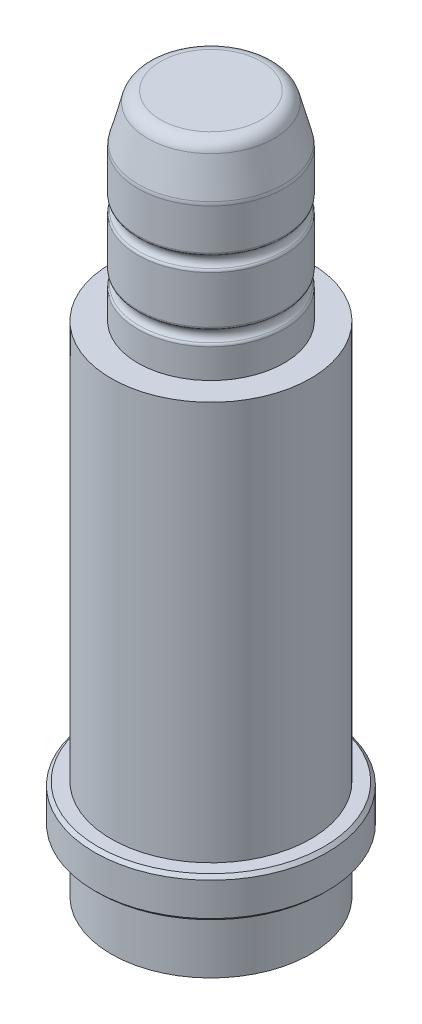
ISO-10303-21;
HEADER;
FILE_DESCRIPTION(('STEP AP214'),'2;1');
FILE_NAME('part.step','',(''),(''),'','','');
FILE_SCHEMA(('AUTOMOTIVE_DESIGN { 1 0 10303 214 1 1 1 1 }'));
ENDSEC;
DATA;
#1=APPLICATION_CONTEXT('core data for automotive mechanical design processes');
#2=APPLICATION_PROTOCOL_DEFINITION('international standard','automotive_design',2000,#1);
#3=PRODUCT_CONTEXT('',#1,'mechanical');
#4=PRODUCT('Part','Part','',(#3));
#5=PRODUCT_RELATED_PRODUCT_CATEGORY('part','',(#4));
#6=PRODUCT_DEFINITION_FORMATION('','',#4);
#7=PRODUCT_DEFINITION_CONTEXT('part definition',#1,'design');
#8=PRODUCT_DEFINITION('design','',#6,#7);
#9=PRODUCT_DEFINITION_SHAPE('','',#8);
#10=(LENGTH_UNIT() NAMED_UNIT(*) SI_UNIT(.MILLI.,.METRE.));
#11=(NAMED_UNIT(*) PLANE_ANGLE_UNIT() SI_UNIT($,.RADIAN.));
#12=(NAMED_UNIT(*) SI_UNIT($,.STERADIAN.) SOLID_ANGLE_UNIT());
#13=UNCERTAINTY_MEASURE_WITH_UNIT(LENGTH_MEASURE(1.E-05),#10,'distance_accuracy_value','');
#14=(GEOMETRIC_REPRESENTATION_CONTEXT(3) GLOBAL_UNCERTAINTY_ASSIGNED_CONTEXT((#13)) GLOBAL_UNIT_ASSIGNED_CONTEXT((#10,
#11,#12)) REPRESENTATION_CONTEXT('',''));
#15=CARTESIAN_POINT('',(0.,0.,0.));
#16=DIRECTION('',(0.,0.,1.));
#17=DIRECTION('',(1.,0.,0.));
#18=AXIS2_PLACEMENT_3D('',#15,#16,#17);
#19=CARTESIAN_POINT('',(0.,6.,0.));
#20=DIRECTION('',(0.,-1.,0.));
#21=DIRECTION('',(0.,0.,-1.));
#22=AXIS2_PLACEMENT_3D('',#19,#20,#21);
#23=CYLINDRICAL_SURFACE('',#22,17.5);
#24=CARTESIAN_POINT('',(0.,5.5,0.));
#25=DIRECTION('',(0.,1.,0.));
#26=DIRECTION('',(0.,0.,1.));
#27=AXIS2_PLACEMENT_3D('',#24,#25,#26);
#28=CIRCLE('',#27,17.5);
#29=CARTESIAN_POINT('',(0.,5.5,17.5));
#30=VERTEX_POINT('',#29);
#31=EDGE_CURVE('E21',#30,#30,#28,.F.);
#32=ORIENTED_EDGE('',*,*,#31,.T.);
#33=EDGE_LOOP('',(#32));
#34=FACE_BOUND('',#33,.T.);
#35=CARTESIAN_POINT('',(0.,0.500000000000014,0.));
#36=DIRECTION('',(0.,1.,0.));
#37=DIRECTION('',(0.,0.,1.));
#38=AXIS2_PLACEMENT_3D('',#35,#36,#37);
#39=CIRCLE('',#38,17.5);
#40=CARTESIAN_POINT('',(0.,0.500000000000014,17.5));
#41=VERTEX_POINT('',#40);
#42=EDGE_CURVE('E29',#41,#41,#39,.T.);
#43=ORIENTED_EDGE('',*,*,#42,.T.);
#44=EDGE_LOOP('',(#43));
#45=FACE_BOUND('',#44,.T.);
#46=ADVANCED_FACE('F13',(#34,#45),#23,.T.);
#47=CARTESIAN_POINT('',(0.,6.,0.));
#48=DIRECTION('',(0.,1.,0.));
#49=DIRECTION('',(0.,0.,1.));
#50=AXIS2_PLACEMENT_3D('',#47,#48,#49);
#51=PLANE('',#50);
#52=CARTESIAN_POINT('',(0.,6.,0.));
#53=DIRECTION('',(0.,1.,0.));
#54=DIRECTION('',(0.,0.,1.));
#55=AXIS2_PLACEMENT_3D('',#52,#53,#54);
#56=CIRCLE('',#55,17.);
#57=CARTESIAN_POINT('',(0.,6.,17.));
#58=VERTEX_POINT('',#57);
#59=EDGE_CURVE('E36',#58,#58,#56,.T.);
#60=ORIENTED_EDGE('',*,*,#59,.T.);
#61=EDGE_LOOP('',(#60));
#62=FACE_BOUND('',#61,.T.);
#63=CARTESIAN_POINT('',(0.,6.,0.));
#64=DIRECTION('',(0.,-1.,0.));
#65=DIRECTION('',(0.,0.,-1.));
#66=AXIS2_PLACEMENT_3D('',#63,#64,#65);
#67=CIRCLE('',#66,15.);
#68=CARTESIAN_POINT('',(0.,6.,-15.));
#69=VERTEX_POINT('',#68);
#70=EDGE_CURVE('E47',#69,#69,#67,.T.);
#71=ORIENTED_EDGE('',*,*,#70,.T.);
#72=EDGE_LOOP('',(#71));
#73=FACE_BOUND('',#72,.T.);
#74=ADVANCED_FACE('F124',(#62,#73),#51,.T.);
#75=CARTESIAN_POINT('',(0.,0.,0.));
#76=DIRECTION('',(0.,1.,0.));
#77=DIRECTION('',(0.,0.,1.));
#78=AXIS2_PLACEMENT_3D('',#75,#76,#77);
#79=PLANE('',#78);
#80=CARTESIAN_POINT('',(0.,0.,0.));
#81=DIRECTION('',(0.,1.,0.));
#82=DIRECTION('',(0.,0.,1.));
#83=AXIS2_PLACEMENT_3D('',#80,#81,#82);
#84=CIRCLE('',#83,17.);
#85=CARTESIAN_POINT('',(0.,0.,17.));
#86=VERTEX_POINT('',#85);
#87=EDGE_CURVE('E8',#86,#86,#84,.F.);
#88=ORIENTED_EDGE('',*,*,#87,.T.);
#89=EDGE_LOOP('',(#88));
#90=FACE_BOUND('',#89,.T.);
#91=CARTESIAN_POINT('',(0.,0.,0.));
#92=DIRECTION('',(0.,1.,0.));
#93=DIRECTION('',(0.,0.,1.));
#94=AXIS2_PLACEMENT_3D('',#91,#92,#93);
#95=CIRCLE('',#94,15.);
#96=CARTESIAN_POINT('',(0.,0.,15.));
#97=VERTEX_POINT('',#96);
#98=EDGE_CURVE('E102',#97,#97,#95,.T.);
#99=ORIENTED_EDGE('',*,*,#98,.T.);
#100=EDGE_LOOP('',(#99));
#101=FACE_BOUND('',#100,.T.);
#102=ADVANCED_FACE('F107',(#90,#101),#79,.F.);
#103=CARTESIAN_POINT('',(0.,66.,0.));
#104=DIRECTION('',(0.,-1.,0.));
#105=DIRECTION('',(0.,0.,-1.));
#106=AXIS2_PLACEMENT_3D('',#103,#104,#105);
#107=PLANE('',#106);
#108=CARTESIAN_POINT('',(0.,66.,0.));
#109=DIRECTION('',(0.,1.,0.));
#110=DIRECTION('',(0.,0.,1.));
#111=AXIS2_PLACEMENT_3D('',#108,#109,#110);
#112=CIRCLE('',#111,11.);
#113=CARTESIAN_POINT('',(0.,66.,11.));
#114=VERTEX_POINT('',#113);
#115=EDGE_CURVE('E42',#114,#114,#112,.T.);
#116=ORIENTED_EDGE('',*,*,#115,.F.);
#117=EDGE_LOOP('',(#116));
#118=FACE_BOUND('',#117,.T.);
#119=CARTESIAN_POINT('',(0.,66.,0.));
#120=DIRECTION('',(0.,-1.,0.));
#121=DIRECTION('',(0.,0.,-1.));
#122=AXIS2_PLACEMENT_3D('',#119,#120,#121);
#123=CIRCLE('',#122,15.);
#124=CARTESIAN_POINT('',(0.,66.,-15.));
#125=VERTEX_POINT('',#124);
#126=EDGE_CURVE('E43',#125,#125,#123,.T.);
#127=ORIENTED_EDGE('',*,*,#126,.F.);
#128=EDGE_LOOP('',(#127));
#129=FACE_BOUND('',#128,.T.);
#130=ADVANCED_FACE('F133',(#118,#129),#107,.F.);
#131=CARTESIAN_POINT('',(0.,6.,0.));
#132=DIRECTION('',(0.,-1.,0.));
#133=DIRECTION('',(0.,0.,-1.));
#134=AXIS2_PLACEMENT_3D('',#131,#132,#133);
#135=CYLINDRICAL_SURFACE('',#134,15.);
#136=ORIENTED_EDGE('',*,*,#70,.F.);
#137=EDGE_LOOP('',(#136));
#138=FACE_BOUND('',#137,.T.);
#139=ORIENTED_EDGE('',*,*,#126,.T.);
#140=EDGE_LOOP('',(#139));
#141=FACE_BOUND('',#140,.T.);
#142=ADVANCED_FACE('F137',(#138,#141),#135,.T.);
#143=CARTESIAN_POINT('',(0.,96.,0.));
#144=DIRECTION('',(0.,1.,0.));
#145=DIRECTION('',(0.,0.,1.));
#146=AXIS2_PLACEMENT_3D('',#143,#144,#145);
#147=PLANE('',#146);
#148=CARTESIAN_POINT('',(0.,96.,0.));
#149=DIRECTION('',(0.,1.,0.));
#150=DIRECTION('',(0.,0.,1.));
#151=AXIS2_PLACEMENT_3D('',#148,#149,#150);
#152=CIRCLE('',#151,7.58970167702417);
#153=CARTESIAN_POINT('',(0.,96.,7.58970167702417));
#154=VERTEX_POINT('',#153);
#155=EDGE_CURVE('E51',#154,#154,#152,.T.);
#156=ORIENTED_EDGE('',*,*,#155,.T.);
#157=EDGE_LOOP('',(#156));
#158=FACE_BOUND('',#157,.T.);
#159=ADVANCED_FACE('F141',(#158),#147,.T.);
#160=CARTESIAN_POINT('',(0.,94.,0.));
#161=DIRECTION('',(0.,1.,0.));
#162=DIRECTION('',(0.,0.,1.));
#163=AXIS2_PLACEMENT_3D('',#160,#161,#162);
#164=TOROIDAL_SURFACE('',#163,7.58970167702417,2.);
#165=CARTESIAN_POINT('',(0.,94.5176380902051,0.));
#166=DIRECTION('',(0.,1.,0.));
#167=DIRECTION('',(0.,0.,1.));
#168=AXIS2_PLACEMENT_3D('',#165,#166,#167);
#169=CIRCLE('',#168,9.5215533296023);
#170=CARTESIAN_POINT('',(0.,94.5176380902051,9.5215533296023));
#171=VERTEX_POINT('',#170);
#172=EDGE_CURVE('E55',#171,#171,#169,.T.);
#173=ORIENTED_EDGE('',*,*,#172,.T.);
#174=EDGE_LOOP('',(#173));
#175=FACE_BOUND('',#174,.T.);
#176=ORIENTED_EDGE('',*,*,#155,.F.);
#177=EDGE_LOOP('',(#176));
#178=FACE_BOUND('',#177,.T.);
#179=ADVANCED_FACE('F145',(#175,#178),#164,.T.);
#180=CARTESIAN_POINT('',(0.,94.5176380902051,0.));
#181=DIRECTION('',(0.,-1.,0.));
#182=DIRECTION('',(0.,0.,-1.));
#183=AXIS2_PLACEMENT_3D('',#180,#181,#182);
#184=CONICAL_SURFACE('',#183,9.5215533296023,0.261799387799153);
#185=CARTESIAN_POINT('',(0.,89.2543330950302,0.));
#186=DIRECTION('',(0.,1.,0.));
#187=DIRECTION('',(0.,0.,1.));
#188=AXIS2_PLACEMENT_3D('',#185,#186,#187);
#189=CIRCLE('',#188,10.9318516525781);
#190=CARTESIAN_POINT('',(0.,89.2543330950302,10.9318516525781));
#191=VERTEX_POINT('',#190);
#192=EDGE_CURVE('E59',#191,#191,#189,.T.);
#193=ORIENTED_EDGE('',*,*,#192,.T.);
#194=EDGE_LOOP('',(#193));
#195=FACE_BOUND('',#194,.T.);
#196=ORIENTED_EDGE('',*,*,#172,.F.);
#197=EDGE_LOOP('',(#196));
#198=FACE_BOUND('',#197,.T.);
#199=ADVANCED_FACE('F149',(#195,#198),#184,.T.);
#200=CARTESIAN_POINT('',(0.,88.7366950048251,0.));
#201=DIRECTION('',(0.,1.,0.));
#202=DIRECTION('',(0.,0.,1.));
#203=AXIS2_PLACEMENT_3D('',#200,#201,#202);
#204=TOROIDAL_SURFACE('',#203,9.,2.);
#205=CARTESIAN_POINT('',(0.,88.7366950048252,0.));
#206=DIRECTION('',(0.,1.,0.));
#207=DIRECTION('',(0.,0.,1.));
#208=AXIS2_PLACEMENT_3D('',#205,#206,#207);
#209=CIRCLE('',#208,11.);
#210=CARTESIAN_POINT('',(0.,88.7366950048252,11.));
#211=VERTEX_POINT('',#210);
#212=EDGE_CURVE('E63',#211,#211,#209,.T.);
#213=ORIENTED_EDGE('',*,*,#212,.T.);
#214=EDGE_LOOP('',(#213));
#215=FACE_BOUND('',#214,.T.);
#216=ORIENTED_EDGE('',*,*,#192,.F.);
#217=EDGE_LOOP('',(#216));
#218=FACE_BOUND('',#217,.T.);
#219=ADVANCED_FACE('F153',(#215,#218),#204,.T.);
#220=CARTESIAN_POINT('',(0.,96.,0.));
#221=DIRECTION('',(0.,1.,0.));
#222=DIRECTION('',(0.,0.,1.));
#223=AXIS2_PLACEMENT_3D('',#220,#221,#222);
#224=CYLINDRICAL_SURFACE('',#223,11.);
#225=CARTESIAN_POINT('',(0.,82.6053529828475,0.));
#226=DIRECTION('',(0.,1.,0.));
#227=DIRECTION('',(0.,0.,1.));
#228=AXIS2_PLACEMENT_3D('',#225,#226,#227);
#229=CIRCLE('',#228,11.);
#230=CARTESIAN_POINT('',(0.,82.6053529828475,11.));
#231=VERTEX_POINT('',#230);
#232=EDGE_CURVE('E67',#231,#231,#229,.T.);
#233=ORIENTED_EDGE('',*,*,#232,.T.);
#234=EDGE_LOOP('',(#233));
#235=FACE_BOUND('',#234,.T.);
#236=ORIENTED_EDGE('',*,*,#212,.F.);
#237=EDGE_LOOP('',(#236));
#238=FACE_BOUND('',#237,.T.);
#239=ADVANCED_FACE('F157',(#235,#238),#224,.T.);
#240=CARTESIAN_POINT('',(0.,82.6053529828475,0.));
#241=DIRECTION('',(0.,1.,0.));
#242=DIRECTION('',(0.,0.,1.));
#243=AXIS2_PLACEMENT_3D('',#240,#241,#242);
#244=TOROIDAL_SURFACE('',#243,10.5,0.5);
#245=CARTESIAN_POINT('',(0.,82.2122772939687,0.));
#246=DIRECTION('',(0.,1.,0.));
#247=DIRECTION('',(0.,0.,1.));
#248=AXIS2_PLACEMENT_3D('',#245,#246,#247);
#249=CIRCLE('',#248,10.8090169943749);
#250=CARTESIAN_POINT('',(0.,82.2122772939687,10.8090169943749));
#251=VERTEX_POINT('',#250);
#252=EDGE_CURVE('E70',#251,#251,#249,.T.);
#253=ORIENTED_EDGE('',*,*,#252,.T.);
#254=EDGE_LOOP('',(#253));
#255=FACE_BOUND('',#254,.T.);
#256=ORIENTED_EDGE('',*,*,#232,.F.);
#257=EDGE_LOOP('',(#256));
#258=FACE_BOUND('',#257,.T.);
#259=ADVANCED_FACE('F161',(#255,#258),#244,.T.);
#260=CARTESIAN_POINT('',(0.,81.3333333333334,0.));
#261=DIRECTION('',(0.,1.,0.));
#262=DIRECTION('',(0.,0.,1.));
#263=AXIS2_PLACEMENT_3D('',#260,#261,#262);
#264=TOROIDAL_SURFACE('',#263,11.5,1.11803398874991);
#265=CARTESIAN_POINT('',(0.,80.454389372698,0.));
#266=DIRECTION('',(0.,1.,0.));
#267=DIRECTION('',(0.,0.,1.));
#268=AXIS2_PLACEMENT_3D('',#265,#266,#267);
#269=CIRCLE('',#268,10.8090169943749);
#270=CARTESIAN_POINT('',(0.,80.454389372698,10.8090169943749));
#271=VERTEX_POINT('',#270);
#272=EDGE_CURVE('E74',#271,#271,#269,.T.);
#273=ORIENTED_EDGE('',*,*,#272,.T.);
#274=EDGE_LOOP('',(#273));
#275=FACE_BOUND('',#274,.T.);
#276=ORIENTED_EDGE('',*,*,#252,.F.);
#277=EDGE_LOOP('',(#276));
#278=FACE_BOUND('',#277,.T.);
#279=ADVANCED_FACE('F165',(#275,#278),#264,.F.);
#280=CARTESIAN_POINT('',(0.,80.0613136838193,0.));
#281=DIRECTION('',(0.,1.,0.));
#282=DIRECTION('',(0.,0.,1.));
#283=AXIS2_PLACEMENT_3D('',#280,#281,#282);
#284=TOROIDAL_SURFACE('',#283,10.5,0.5);
#285=CARTESIAN_POINT('',(0.,80.0613136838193,0.));
#286=DIRECTION('',(0.,1.,0.));
#287=DIRECTION('',(0.,0.,1.));
#288=AXIS2_PLACEMENT_3D('',#285,#286,#287);
#289=CIRCLE('',#288,11.);
#290=CARTESIAN_POINT('',(0.,80.0613136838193,11.));
#291=VERTEX_POINT('',#290);
#292=EDGE_CURVE('E78',#291,#291,#289,.T.);
#293=ORIENTED_EDGE('',*,*,#292,.T.);
#294=EDGE_LOOP('',(#293));
#295=FACE_BOUND('',#294,.T.);
#296=ORIENTED_EDGE('',*,*,#272,.F.);
#297=EDGE_LOOP('',(#296));
#298=FACE_BOUND('',#297,.T.);
#299=ADVANCED_FACE('F169',(#295,#298),#284,.T.);
#300=CARTESIAN_POINT('',(0.,96.,0.));
#301=DIRECTION('',(0.,1.,0.));
#302=DIRECTION('',(0.,0.,1.));
#303=AXIS2_PLACEMENT_3D('',#300,#301,#302);
#304=CYLINDRICAL_SURFACE('',#303,11.);
#305=CARTESIAN_POINT('',(0.,72.9386863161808,0.));
#306=DIRECTION('',(0.,1.,0.));
#307=DIRECTION('',(0.,0.,1.));
#308=AXIS2_PLACEMENT_3D('',#305,#306,#307);
#309=CIRCLE('',#308,11.);
#310=CARTESIAN_POINT('',(0.,72.9386863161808,11.));
#311=VERTEX_POINT('',#310);
#312=EDGE_CURVE('E82',#311,#311,#309,.T.);
#313=ORIENTED_EDGE('',*,*,#312,.T.);
#314=EDGE_LOOP('',(#313));
#315=FACE_BOUND('',#314,.T.);
#316=ORIENTED_EDGE('',*,*,#292,.F.);
#317=EDGE_LOOP('',(#316));
#318=FACE_BOUND('',#317,.T.);
#319=ADVANCED_FACE('F173',(#315,#318),#304,.T.);
#320=CARTESIAN_POINT('',(0.,72.9386863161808,0.));
#321=DIRECTION('',(0.,1.,0.));
#322=DIRECTION('',(0.,0.,1.));
#323=AXIS2_PLACEMENT_3D('',#320,#321,#322);
#324=TOROIDAL_SURFACE('',#323,10.5,0.5);
#325=CARTESIAN_POINT('',(0.,72.545610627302,0.));
#326=DIRECTION('',(0.,1.,0.));
#327=DIRECTION('',(0.,0.,1.));
#328=AXIS2_PLACEMENT_3D('',#325,#326,#327);
#329=CIRCLE('',#328,10.8090169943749);
#330=CARTESIAN_POINT('',(0.,72.545610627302,10.8090169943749));
#331=VERTEX_POINT('',#330);
#332=EDGE_CURVE('E86',#331,#331,#329,.T.);
#333=ORIENTED_EDGE('',*,*,#332,.T.);
#334=EDGE_LOOP('',(#333));
#335=FACE_BOUND('',#334,.T.);
#336=ORIENTED_EDGE('',*,*,#312,.F.);
#337=EDGE_LOOP('',(#336));
#338=FACE_BOUND('',#337,.T.);
#339=ADVANCED_FACE('F177',(#335,#338),#324,.T.);
#340=CARTESIAN_POINT('',(0.,71.6666666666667,0.));
#341=DIRECTION('',(0.,1.,0.));
#342=DIRECTION('',(0.,0.,1.));
#343=AXIS2_PLACEMENT_3D('',#340,#341,#342);
#344=TOROIDAL_SURFACE('',#343,11.5,1.11803398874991);
#345=CARTESIAN_POINT('',(0.,70.7877227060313,0.));
#346=DIRECTION('',(0.,1.,0.));
#347=DIRECTION('',(0.,0.,1.));
#348=AXIS2_PLACEMENT_3D('',#345,#346,#347);
#349=CIRCLE('',#348,10.8090169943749);
#350=CARTESIAN_POINT('',(0.,70.7877227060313,10.8090169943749));
#351=VERTEX_POINT('',#350);
#352=EDGE_CURVE('E90',#351,#351,#349,.T.);
#353=ORIENTED_EDGE('',*,*,#352,.T.);
#354=EDGE_LOOP('',(#353));
#355=FACE_BOUND('',#354,.T.);
#356=ORIENTED_EDGE('',*,*,#332,.F.);
#357=EDGE_LOOP('',(#356));
#358=FACE_BOUND('',#357,.T.);
#359=ADVANCED_FACE('F181',(#355,#358),#344,.F.);
#360=CARTESIAN_POINT('',(0.,70.3946470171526,0.));
#361=DIRECTION('',(0.,1.,0.));
#362=DIRECTION('',(0.,0.,1.));
#363=AXIS2_PLACEMENT_3D('',#360,#361,#362);
#364=TOROIDAL_SURFACE('',#363,10.5,0.5);
#365=CARTESIAN_POINT('',(0.,70.3946470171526,0.));
#366=DIRECTION('',(0.,1.,0.));
#367=DIRECTION('',(0.,0.,1.));
#368=AXIS2_PLACEMENT_3D('',#365,#366,#367);
#369=CIRCLE('',#368,11.);
#370=CARTESIAN_POINT('',(0.,70.3946470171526,11.));
#371=VERTEX_POINT('',#370);
#372=EDGE_CURVE('E94',#371,#371,#369,.T.);
#373=ORIENTED_EDGE('',*,*,#372,.T.);
#374=EDGE_LOOP('',(#373));
#375=FACE_BOUND('',#374,.T.);
#376=ORIENTED_EDGE('',*,*,#352,.F.);
#377=EDGE_LOOP('',(#376));
#378=FACE_BOUND('',#377,.T.);
#379=ADVANCED_FACE('F185',(#375,#378),#364,.T.);
#380=CARTESIAN_POINT('',(0.,96.,0.));
#381=DIRECTION('',(0.,1.,0.));
#382=DIRECTION('',(0.,0.,1.));
#383=AXIS2_PLACEMENT_3D('',#380,#381,#382);
#384=CYLINDRICAL_SURFACE('',#383,11.);
#385=ORIENTED_EDGE('',*,*,#115,.T.);
#386=EDGE_LOOP('',(#385));
#387=FACE_BOUND('',#386,.T.);
#388=ORIENTED_EDGE('',*,*,#372,.F.);
#389=EDGE_LOOP('',(#388));
#390=FACE_BOUND('',#389,.T.);
#391=ADVANCED_FACE('F120',(#387,#390),#384,.T.);
#392=CARTESIAN_POINT('',(0.,-9.,0.));
#393=DIRECTION('',(0.,-1.,0.));
#394=DIRECTION('',(0.,0.,-1.));
#395=AXIS2_PLACEMENT_3D('',#392,#393,#394);
#396=PLANE('',#395);
#397=CARTESIAN_POINT('',(0.,-9.,0.));
#398=DIRECTION('',(0.,1.,0.));
#399=DIRECTION('',(0.,0.,1.));
#400=AXIS2_PLACEMENT_3D('',#397,#398,#399);
#401=CIRCLE('',#400,15.);
#402=CARTESIAN_POINT('',(0.,-9.,15.));
#403=VERTEX_POINT('',#402);
#404=EDGE_CURVE('E97',#403,#403,#401,.T.);
#405=ORIENTED_EDGE('',*,*,#404,.F.);
#406=EDGE_LOOP('',(#405));
#407=FACE_BOUND('',#406,.T.);
#408=ADVANCED_FACE('F112',(#407),#396,.T.);
#409=CARTESIAN_POINT('',(0.,0.,0.));
#410=DIRECTION('',(0.,1.,0.));
#411=DIRECTION('',(0.,0.,1.));
#412=AXIS2_PLACEMENT_3D('',#409,#410,#411);
#413=CYLINDRICAL_SURFACE('',#412,15.);
#414=ORIENTED_EDGE('',*,*,#404,.T.);
#415=EDGE_LOOP('',(#414));
#416=FACE_BOUND('',#415,.T.);
#417=ORIENTED_EDGE('',*,*,#98,.F.);
#418=EDGE_LOOP('',(#417));
#419=FACE_BOUND('',#418,.T.);
#420=ADVANCED_FACE('F109',(#416,#419),#413,.T.);
#421=CARTESIAN_POINT('',(0.,6.,0.));
#422=DIRECTION('',(0.,-1.,0.));
#423=DIRECTION('',(0.,0.,-1.));
#424=AXIS2_PLACEMENT_3D('',#421,#422,#423);
#425=CONICAL_SURFACE('',#424,17.,0.785398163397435);
#426=ORIENTED_EDGE('',*,*,#31,.F.);
#427=EDGE_LOOP('',(#426));
#428=FACE_BOUND('',#427,.T.);
#429=ORIENTED_EDGE('',*,*,#59,.F.);
#430=EDGE_LOOP('',(#429));
#431=FACE_BOUND('',#430,.T.);
#432=ADVANCED_FACE('F111',(#428,#431),#425,.T.);
#433=CARTESIAN_POINT('',(0.,0.500000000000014,0.));
#434=DIRECTION('',(0.,1.,0.));
#435=DIRECTION('',(0.,0.,1.));
#436=AXIS2_PLACEMENT_3D('',#433,#434,#435);
#437=CONICAL_SURFACE('',#436,17.5,0.785398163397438);
#438=ORIENTED_EDGE('',*,*,#87,.F.);
#439=EDGE_LOOP('',(#438));
#440=FACE_BOUND('',#439,.T.);
#441=ORIENTED_EDGE('',*,*,#42,.F.);
#442=EDGE_LOOP('',(#441));
#443=FACE_BOUND('',#442,.T.);
#444=ADVANCED_FACE('F15',(#440,#443),#437,.T.);
#445=CLOSED_SHELL('',(#46,#74,#102,#130,#142,#159,#179,#199,#219,#239,#259,#279,#299,#319,#339,
#359,#379,#391,#408,#420,#432,#444));
#446=MANIFOLD_SOLID_BREP('B1',#445);
#447=ADVANCED_BREP_SHAPE_REPRESENTATION('',(#18,#446),#14);
#448=SHAPE_DEFINITION_REPRESENTATION(#9,#447);
ENDSEC;
END-ISO-10303-21;
